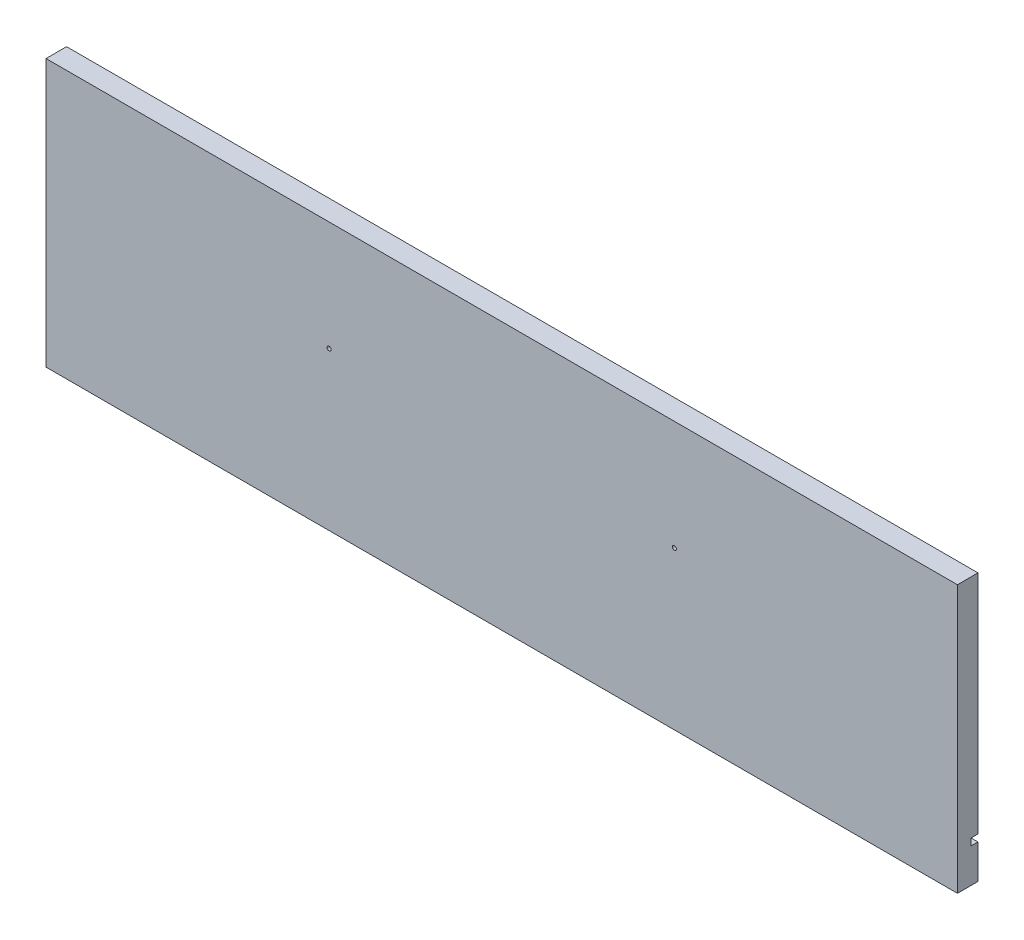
ISO-10303-21;
HEADER;
FILE_DESCRIPTION(('STEP AP214'),'2;1');
FILE_NAME('part.step','',(''),(''),'','','');
FILE_SCHEMA(('AUTOMOTIVE_DESIGN { 1 0 10303 214 1 1 1 1 }'));
ENDSEC;
DATA;
#1=APPLICATION_CONTEXT('core data for automotive mechanical design processes');
#2=APPLICATION_PROTOCOL_DEFINITION('international standard','automotive_design',2000,#1);
#3=PRODUCT_CONTEXT('',#1,'mechanical');
#4=PRODUCT('Part','Part','',(#3));
#5=PRODUCT_RELATED_PRODUCT_CATEGORY('part','',(#4));
#6=PRODUCT_DEFINITION_FORMATION('','',#4);
#7=PRODUCT_DEFINITION_CONTEXT('part definition',#1,'design');
#8=PRODUCT_DEFINITION('design','',#6,#7);
#9=PRODUCT_DEFINITION_SHAPE('','',#8);
#10=(LENGTH_UNIT() NAMED_UNIT(*) SI_UNIT(.MILLI.,.METRE.));
#11=(NAMED_UNIT(*) PLANE_ANGLE_UNIT() SI_UNIT($,.RADIAN.));
#12=(NAMED_UNIT(*) SI_UNIT($,.STERADIAN.) SOLID_ANGLE_UNIT());
#13=UNCERTAINTY_MEASURE_WITH_UNIT(LENGTH_MEASURE(1.E-05),#10,'distance_accuracy_value','');
#14=(GEOMETRIC_REPRESENTATION_CONTEXT(3) GLOBAL_UNCERTAINTY_ASSIGNED_CONTEXT((#13)) GLOBAL_UNIT_ASSIGNED_CONTEXT((#10,
#11,#12)) REPRESENTATION_CONTEXT('',''));
#15=CARTESIAN_POINT('',(0.,0.,0.));
#16=DIRECTION('',(0.,0.,1.));
#17=DIRECTION('',(1.,0.,0.));
#18=AXIS2_PLACEMENT_3D('',#15,#16,#17);
#19=CARTESIAN_POINT('',(-332.5,195.,-15.));
#20=DIRECTION('',(0.,0.,-1.));
#21=DIRECTION('',(-1.,0.,0.));
#22=AXIS2_PLACEMENT_3D('',#19,#20,#21);
#23=PLANE('',#22);
#24=CARTESIAN_POINT('',(325.,135.,-15.));
#25=DIRECTION('',(0.,0.,-1.));
#26=DIRECTION('',(-1.,0.,0.));
#27=AXIS2_PLACEMENT_3D('',#24,#25,#26);
#28=CIRCLE('',#27,1.5);
#29=CARTESIAN_POINT('',(323.5,135.,-15.));
#30=VERTEX_POINT('',#29);
#31=EDGE_CURVE('E113',#30,#30,#28,.T.);
#32=ORIENTED_EDGE('',*,*,#31,.F.);
#33=EDGE_LOOP('',(#32));
#34=FACE_BOUND('',#33,.T.);
#35=CARTESIAN_POINT('',(325.,45.0000000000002,-15.));
#36=DIRECTION('',(0.,0.,-1.));
#37=DIRECTION('',(-1.,0.,0.));
#38=AXIS2_PLACEMENT_3D('',#35,#36,#37);
#39=CIRCLE('',#38,1.5);
#40=CARTESIAN_POINT('',(323.5,45.0000000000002,-15.));
#41=VERTEX_POINT('',#40);
#42=EDGE_CURVE('E121',#41,#41,#39,.T.);
#43=ORIENTED_EDGE('',*,*,#42,.F.);
#44=EDGE_LOOP('',(#43));
#45=FACE_BOUND('',#44,.T.);
#46=CARTESIAN_POINT('',(-325.,135.000000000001,-15.));
#47=DIRECTION('',(0.,0.,-1.));
#48=DIRECTION('',(-1.,0.,0.));
#49=AXIS2_PLACEMENT_3D('',#46,#47,#48);
#50=CIRCLE('',#49,1.5);
#51=CARTESIAN_POINT('',(-326.5,135.000000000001,-15.));
#52=VERTEX_POINT('',#51);
#53=EDGE_CURVE('E127',#52,#52,#50,.T.);
#54=ORIENTED_EDGE('',*,*,#53,.F.);
#55=EDGE_LOOP('',(#54));
#56=FACE_BOUND('',#55,.T.);
#57=CARTESIAN_POINT('',(-325.,45.0000000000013,-15.));
#58=DIRECTION('',(0.,0.,-1.));
#59=DIRECTION('',(-1.,0.,0.));
#60=AXIS2_PLACEMENT_3D('',#57,#58,#59);
#61=CIRCLE('',#60,1.5);
#62=CARTESIAN_POINT('',(-326.5,45.0000000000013,-15.));
#63=VERTEX_POINT('',#62);
#64=EDGE_CURVE('E133',#63,#63,#61,.T.);
#65=ORIENTED_EDGE('',*,*,#64,.F.);
#66=EDGE_LOOP('',(#65));
#67=FACE_BOUND('',#66,.T.);
#68=CARTESIAN_POINT('',(126.,115.,-15.));
#69=DIRECTION('',(0.,0.,1.));
#70=DIRECTION('',(1.,0.,0.));
#71=AXIS2_PLACEMENT_3D('',#68,#69,#70);
#72=CIRCLE('',#71,1.5);
#73=CARTESIAN_POINT('',(127.5,115.,-15.));
#74=VERTEX_POINT('',#73);
#75=EDGE_CURVE('E142',#74,#74,#72,.T.);
#76=ORIENTED_EDGE('',*,*,#75,.T.);
#77=EDGE_LOOP('',(#76));
#78=FACE_BOUND('',#77,.T.);
#79=DIRECTION('',(1.,0.,0.));
#80=VECTOR('',#79,1.);
#81=CARTESIAN_POINT('',(-332.5,30.0000000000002,-15.));
#82=LINE('',#81,#80);
#83=CARTESIAN_POINT('',(-332.5,30.0000000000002,-15.));
#84=VERTEX_POINT('',#83);
#85=CARTESIAN_POINT('',(332.5,30.0000000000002,-15.));
#86=VERTEX_POINT('',#85);
#87=EDGE_CURVE('E163',#84,#86,#82,.T.);
#88=ORIENTED_EDGE('',*,*,#87,.F.);
#89=DIRECTION('',(0.,-1.,0.));
#90=VECTOR('',#89,1.);
#91=CARTESIAN_POINT('',(-332.5,0.,-15.));
#92=LINE('',#91,#90);
#93=CARTESIAN_POINT('',(-332.5,195.,-15.));
#94=VERTEX_POINT('',#93);
#95=EDGE_CURVE('E185',#94,#84,#92,.T.);
#96=ORIENTED_EDGE('',*,*,#95,.F.);
#97=DIRECTION('',(-1.,0.,0.));
#98=VECTOR('',#97,1.);
#99=CARTESIAN_POINT('',(-332.5,195.,-15.));
#100=LINE('',#99,#98);
#101=CARTESIAN_POINT('',(332.5,195.,-15.));
#102=VERTEX_POINT('',#101);
#103=EDGE_CURVE('E194',#102,#94,#100,.T.);
#104=ORIENTED_EDGE('',*,*,#103,.F.);
#105=DIRECTION('',(0.,1.,0.));
#106=VECTOR('',#105,1.);
#107=CARTESIAN_POINT('',(332.5,1.22154483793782E-13,-15.));
#108=LINE('',#107,#106);
#109=EDGE_CURVE('E190',#86,#102,#108,.T.);
#110=ORIENTED_EDGE('',*,*,#109,.F.);
#111=EDGE_LOOP('',(#88,#96,#104,#110));
#112=FACE_BOUND('',#111,.T.);
#113=CARTESIAN_POINT('',(-126.,115.,-15.));
#114=DIRECTION('',(0.,0.,1.));
#115=DIRECTION('',(1.,0.,0.));
#116=AXIS2_PLACEMENT_3D('',#113,#114,#115);
#117=CIRCLE('',#116,1.5);
#118=CARTESIAN_POINT('',(-124.5,115.,-15.));
#119=VERTEX_POINT('',#118);
#120=EDGE_CURVE('E136',#119,#119,#117,.T.);
#121=ORIENTED_EDGE('',*,*,#120,.T.);
#122=EDGE_LOOP('',(#121));
#123=FACE_BOUND('',#122,.T.);
#124=ADVANCED_FACE('F28',(#34,#45,#56,#67,#78,#112,#123),#23,.T.);
#125=DIRECTION('',(1.,0.,0.));
#126=VECTOR('',#125,1.);
#127=CARTESIAN_POINT('',(-332.5,25.0000000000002,-15.));
#128=LINE('',#127,#126);
#129=CARTESIAN_POINT('',(-332.5,25.0000000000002,-15.));
#130=VERTEX_POINT('',#129);
#131=CARTESIAN_POINT('',(332.5,25.0000000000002,-15.));
#132=VERTEX_POINT('',#131);
#133=EDGE_CURVE('E164',#130,#132,#128,.T.);
#134=ORIENTED_EDGE('',*,*,#133,.T.);
#135=CARTESIAN_POINT('',(332.5,1.22154483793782E-13,-15.));
#136=VERTEX_POINT('',#135);
#137=EDGE_CURVE('E191',#136,#132,#108,.T.);
#138=ORIENTED_EDGE('',*,*,#137,.F.);
#139=DIRECTION('',(1.,0.,0.));
#140=VECTOR('',#139,1.);
#141=CARTESIAN_POINT('',(-332.5,0.,-15.));
#142=LINE('',#141,#140);
#143=CARTESIAN_POINT('',(-332.5,0.,-15.));
#144=VERTEX_POINT('',#143);
#145=EDGE_CURVE('E187',#144,#136,#142,.T.);
#146=ORIENTED_EDGE('',*,*,#145,.F.);
#147=EDGE_CURVE('E184',#130,#144,#92,.T.);
#148=ORIENTED_EDGE('',*,*,#147,.F.);
#149=EDGE_LOOP('',(#134,#138,#146,#148));
#150=FACE_BOUND('',#149,.T.);
#151=ADVANCED_FACE('F225',(#150),#23,.T.);
#152=CARTESIAN_POINT('',(-332.5,0.,-15.));
#153=DIRECTION('',(-1.,0.,0.));
#154=DIRECTION('',(0.,0.,1.));
#155=AXIS2_PLACEMENT_3D('',#152,#153,#154);
#156=PLANE('',#155);
#157=DIRECTION('',(0.,0.,-1.));
#158=VECTOR('',#157,1.);
#159=CARTESIAN_POINT('',(-332.5,25.0000000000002,-15.));
#160=LINE('',#159,#158);
#161=CARTESIAN_POINT('',(-332.5,25.0000000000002,-10.));
#162=VERTEX_POINT('',#161);
#163=EDGE_CURVE('E160',#162,#130,#160,.T.);
#164=ORIENTED_EDGE('',*,*,#163,.T.);
#165=ORIENTED_EDGE('',*,*,#147,.T.);
#166=DIRECTION('',(0.,0.,1.));
#167=VECTOR('',#166,1.);
#168=CARTESIAN_POINT('',(-332.5,0.,-15.));
#169=LINE('',#168,#167);
#170=CARTESIAN_POINT('',(-332.5,0.,0.));
#171=VERTEX_POINT('',#170);
#172=EDGE_CURVE('E32',#144,#171,#169,.T.);
#173=ORIENTED_EDGE('',*,*,#172,.T.);
#174=DIRECTION('',(0.,-1.,0.));
#175=VECTOR('',#174,1.);
#176=CARTESIAN_POINT('',(-332.5,0.,0.));
#177=LINE('',#176,#175);
#178=CARTESIAN_POINT('',(-332.5,195.,0.));
#179=VERTEX_POINT('',#178);
#180=EDGE_CURVE('E167',#179,#171,#177,.T.);
#181=ORIENTED_EDGE('',*,*,#180,.F.);
#182=DIRECTION('',(0.,0.,1.));
#183=VECTOR('',#182,1.);
#184=CARTESIAN_POINT('',(-332.5,195.,-15.));
#185=LINE('',#184,#183);
#186=EDGE_CURVE('E11',#94,#179,#185,.T.);
#187=ORIENTED_EDGE('',*,*,#186,.F.);
#188=ORIENTED_EDGE('',*,*,#95,.T.);
#189=DIRECTION('',(0.,0.,1.));
#190=VECTOR('',#189,1.);
#191=CARTESIAN_POINT('',(-332.5,30.0000000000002,-15.));
#192=LINE('',#191,#190);
#193=CARTESIAN_POINT('',(-332.5,30.0000000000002,-10.));
#194=VERTEX_POINT('',#193);
#195=EDGE_CURVE('E45',#84,#194,#192,.T.);
#196=ORIENTED_EDGE('',*,*,#195,.T.);
#197=DIRECTION('',(0.,-1.,0.));
#198=VECTOR('',#197,1.);
#199=CARTESIAN_POINT('',(-332.5,25.0000000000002,-10.));
#200=LINE('',#199,#198);
#201=EDGE_CURVE('E157',#194,#162,#200,.T.);
#202=ORIENTED_EDGE('',*,*,#201,.T.);
#203=EDGE_LOOP('',(#164,#165,#173,#181,#187,#188,#196,#202));
#204=FACE_BOUND('',#203,.T.);
#205=ADVANCED_FACE('F30',(#204),#156,.T.);
#206=CARTESIAN_POINT('',(-332.5,195.,-15.));
#207=DIRECTION('',(0.,1.,0.));
#208=DIRECTION('',(-1.,0.,0.));
#209=AXIS2_PLACEMENT_3D('',#206,#207,#208);
#210=PLANE('',#209);
#211=DIRECTION('',(-1.,0.,0.));
#212=VECTOR('',#211,1.);
#213=CARTESIAN_POINT('',(-332.5,195.,0.));
#214=LINE('',#213,#212);
#215=CARTESIAN_POINT('',(332.5,195.,0.));
#216=VERTEX_POINT('',#215);
#217=EDGE_CURVE('E181',#216,#179,#214,.T.);
#218=ORIENTED_EDGE('',*,*,#217,.F.);
#219=DIRECTION('',(0.,0.,1.));
#220=VECTOR('',#219,1.);
#221=CARTESIAN_POINT('',(332.5,195.,-15.));
#222=LINE('',#221,#220);
#223=EDGE_CURVE('E37',#102,#216,#222,.T.);
#224=ORIENTED_EDGE('',*,*,#223,.F.);
#225=ORIENTED_EDGE('',*,*,#103,.T.);
#226=ORIENTED_EDGE('',*,*,#186,.T.);
#227=EDGE_LOOP('',(#218,#224,#225,#226));
#228=FACE_BOUND('',#227,.T.);
#229=ADVANCED_FACE('F210',(#228),#210,.T.);
#230=CARTESIAN_POINT('',(332.5,1.22154483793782E-13,-15.));
#231=DIRECTION('',(1.,0.,0.));
#232=DIRECTION('',(0.,1.,0.));
#233=AXIS2_PLACEMENT_3D('',#230,#231,#232);
#234=PLANE('',#233);
#235=DIRECTION('',(0.,0.,-1.));
#236=VECTOR('',#235,1.);
#237=CARTESIAN_POINT('',(332.5,25.0000000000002,-15.));
#238=LINE('',#237,#236);
#239=CARTESIAN_POINT('',(332.5,25.0000000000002,-10.));
#240=VERTEX_POINT('',#239);
#241=EDGE_CURVE('E154',#240,#132,#238,.T.);
#242=ORIENTED_EDGE('',*,*,#241,.F.);
#243=DIRECTION('',(0.,-1.,0.));
#244=VECTOR('',#243,1.);
#245=CARTESIAN_POINT('',(332.5,25.0000000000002,-10.));
#246=LINE('',#245,#244);
#247=CARTESIAN_POINT('',(332.5,30.0000000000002,-10.));
#248=VERTEX_POINT('',#247);
#249=EDGE_CURVE('E151',#248,#240,#246,.T.);
#250=ORIENTED_EDGE('',*,*,#249,.F.);
#251=DIRECTION('',(0.,0.,1.));
#252=VECTOR('',#251,1.);
#253=CARTESIAN_POINT('',(332.5,30.0000000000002,-15.));
#254=LINE('',#253,#252);
#255=EDGE_CURVE('E148',#86,#248,#254,.T.);
#256=ORIENTED_EDGE('',*,*,#255,.F.);
#257=ORIENTED_EDGE('',*,*,#109,.T.);
#258=ORIENTED_EDGE('',*,*,#223,.T.);
#259=DIRECTION('',(0.,1.,0.));
#260=VECTOR('',#259,1.);
#261=CARTESIAN_POINT('',(332.5,1.22154483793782E-13,0.));
#262=LINE('',#261,#260);
#263=CARTESIAN_POINT('',(332.5,1.22154483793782E-13,0.));
#264=VERTEX_POINT('',#263);
#265=EDGE_CURVE('E178',#264,#216,#262,.T.);
#266=ORIENTED_EDGE('',*,*,#265,.F.);
#267=DIRECTION('',(0.,0.,1.));
#268=VECTOR('',#267,1.);
#269=CARTESIAN_POINT('',(332.5,1.22154483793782E-13,-15.));
#270=LINE('',#269,#268);
#271=EDGE_CURVE('E197',#136,#264,#270,.T.);
#272=ORIENTED_EDGE('',*,*,#271,.F.);
#273=ORIENTED_EDGE('',*,*,#137,.T.);
#274=EDGE_LOOP('',(#242,#250,#256,#257,#258,#266,#272,#273));
#275=FACE_BOUND('',#274,.T.);
#276=ADVANCED_FACE('F227',(#275),#234,.T.);
#277=CARTESIAN_POINT('',(-332.5,0.,-15.));
#278=DIRECTION('',(0.,-1.,0.));
#279=DIRECTION('',(1.,0.,0.));
#280=AXIS2_PLACEMENT_3D('',#277,#278,#279);
#281=PLANE('',#280);
#282=DIRECTION('',(1.,0.,0.));
#283=VECTOR('',#282,1.);
#284=CARTESIAN_POINT('',(-332.5,0.,0.));
#285=LINE('',#284,#283);
#286=EDGE_CURVE('E175',#171,#264,#285,.T.);
#287=ORIENTED_EDGE('',*,*,#286,.F.);
#288=ORIENTED_EDGE('',*,*,#172,.F.);
#289=ORIENTED_EDGE('',*,*,#145,.T.);
#290=ORIENTED_EDGE('',*,*,#271,.T.);
#291=EDGE_LOOP('',(#287,#288,#289,#290));
#292=FACE_BOUND('',#291,.T.);
#293=ADVANCED_FACE('F204',(#292),#281,.T.);
#294=CARTESIAN_POINT('',(-332.5,195.,0.));
#295=DIRECTION('',(0.,0.,-1.));
#296=DIRECTION('',(-1.,0.,0.));
#297=AXIS2_PLACEMENT_3D('',#294,#295,#296);
#298=PLANE('',#297);
#299=CARTESIAN_POINT('',(-126.,115.,0.));
#300=DIRECTION('',(0.,0.,1.));
#301=DIRECTION('',(1.,0.,0.));
#302=AXIS2_PLACEMENT_3D('',#299,#300,#301);
#303=CIRCLE('',#302,1.5);
#304=CARTESIAN_POINT('',(-124.5,115.,0.));
#305=VERTEX_POINT('',#304);
#306=EDGE_CURVE('E139',#305,#305,#303,.T.);
#307=ORIENTED_EDGE('',*,*,#306,.F.);
#308=EDGE_LOOP('',(#307));
#309=FACE_BOUND('',#308,.T.);
#310=CARTESIAN_POINT('',(126.,115.,0.));
#311=DIRECTION('',(0.,0.,1.));
#312=DIRECTION('',(1.,0.,0.));
#313=AXIS2_PLACEMENT_3D('',#310,#311,#312);
#314=CIRCLE('',#313,1.5);
#315=CARTESIAN_POINT('',(127.5,115.,0.));
#316=VERTEX_POINT('',#315);
#317=EDGE_CURVE('E145',#316,#316,#314,.T.);
#318=ORIENTED_EDGE('',*,*,#317,.F.);
#319=EDGE_LOOP('',(#318));
#320=FACE_BOUND('',#319,.T.);
#321=ORIENTED_EDGE('',*,*,#180,.T.);
#322=ORIENTED_EDGE('',*,*,#286,.T.);
#323=ORIENTED_EDGE('',*,*,#265,.T.);
#324=ORIENTED_EDGE('',*,*,#217,.T.);
#325=EDGE_LOOP('',(#321,#322,#323,#324));
#326=FACE_BOUND('',#325,.T.);
#327=ADVANCED_FACE('F206',(#309,#320,#326),#298,.F.);
#328=CARTESIAN_POINT('',(-332.5,25.0000000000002,-15.));
#329=DIRECTION('',(0.,-1.,0.));
#330=DIRECTION('',(0.,0.,-1.));
#331=AXIS2_PLACEMENT_3D('',#328,#329,#330);
#332=PLANE('',#331);
#333=ORIENTED_EDGE('',*,*,#241,.T.);
#334=ORIENTED_EDGE('',*,*,#133,.F.);
#335=ORIENTED_EDGE('',*,*,#163,.F.);
#336=DIRECTION('',(1.,0.,0.));
#337=VECTOR('',#336,1.);
#338=CARTESIAN_POINT('',(-332.5,25.0000000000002,-10.));
#339=LINE('',#338,#337);
#340=EDGE_CURVE('E168',#162,#240,#339,.T.);
#341=ORIENTED_EDGE('',*,*,#340,.T.);
#342=EDGE_LOOP('',(#333,#334,#335,#341));
#343=FACE_BOUND('',#342,.T.);
#344=ADVANCED_FACE('F222',(#343),#332,.F.);
#345=CARTESIAN_POINT('',(-332.5,25.0000000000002,-10.));
#346=DIRECTION('',(0.,0.,1.));
#347=DIRECTION('',(1.,0.,0.));
#348=AXIS2_PLACEMENT_3D('',#345,#346,#347);
#349=PLANE('',#348);
#350=ORIENTED_EDGE('',*,*,#249,.T.);
#351=ORIENTED_EDGE('',*,*,#340,.F.);
#352=ORIENTED_EDGE('',*,*,#201,.F.);
#353=DIRECTION('',(1.,0.,0.));
#354=VECTOR('',#353,1.);
#355=CARTESIAN_POINT('',(-332.5,30.0000000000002,-10.));
#356=LINE('',#355,#354);
#357=EDGE_CURVE('E170',#194,#248,#356,.T.);
#358=ORIENTED_EDGE('',*,*,#357,.T.);
#359=EDGE_LOOP('',(#350,#351,#352,#358));
#360=FACE_BOUND('',#359,.T.);
#361=ADVANCED_FACE('F218',(#360),#349,.F.);
#362=CARTESIAN_POINT('',(-332.5,30.0000000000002,-15.));
#363=DIRECTION('',(0.,1.,0.));
#364=DIRECTION('',(0.,0.,1.));
#365=AXIS2_PLACEMENT_3D('',#362,#363,#364);
#366=PLANE('',#365);
#367=ORIENTED_EDGE('',*,*,#255,.T.);
#368=ORIENTED_EDGE('',*,*,#357,.F.);
#369=ORIENTED_EDGE('',*,*,#195,.F.);
#370=ORIENTED_EDGE('',*,*,#87,.T.);
#371=EDGE_LOOP('',(#367,#368,#369,#370));
#372=FACE_BOUND('',#371,.T.);
#373=ADVANCED_FACE('F229',(#372),#366,.F.);
#374=CARTESIAN_POINT('',(126.,115.,0.));
#375=DIRECTION('',(0.,0.,1.));
#376=DIRECTION('',(1.,0.,0.));
#377=AXIS2_PLACEMENT_3D('',#374,#375,#376);
#378=CYLINDRICAL_SURFACE('',#377,1.5);
#379=ORIENTED_EDGE('',*,*,#75,.F.);
#380=EDGE_LOOP('',(#379));
#381=FACE_BOUND('',#380,.T.);
#382=ORIENTED_EDGE('',*,*,#317,.T.);
#383=EDGE_LOOP('',(#382));
#384=FACE_BOUND('',#383,.T.);
#385=ADVANCED_FACE('F231',(#381,#384),#378,.F.);
#386=CARTESIAN_POINT('',(-126.,115.,0.));
#387=DIRECTION('',(0.,0.,1.));
#388=DIRECTION('',(1.,0.,0.));
#389=AXIS2_PLACEMENT_3D('',#386,#387,#388);
#390=CYLINDRICAL_SURFACE('',#389,1.5);
#391=ORIENTED_EDGE('',*,*,#120,.F.);
#392=EDGE_LOOP('',(#391));
#393=FACE_BOUND('',#392,.T.);
#394=ORIENTED_EDGE('',*,*,#306,.T.);
#395=EDGE_LOOP('',(#394));
#396=FACE_BOUND('',#395,.T.);
#397=ADVANCED_FACE('F238',(#393,#396),#390,.F.);
#398=CARTESIAN_POINT('',(-325.,45.0000000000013,-15.));
#399=DIRECTION('',(0.,0.,-1.));
#400=DIRECTION('',(-1.,0.,0.));
#401=AXIS2_PLACEMENT_3D('',#398,#399,#400);
#402=CYLINDRICAL_SURFACE('',#401,1.5);
#403=CARTESIAN_POINT('',(-325.,45.0000000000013,-5.));
#404=DIRECTION('',(0.,0.,-1.));
#405=DIRECTION('',(-1.,0.,0.));
#406=AXIS2_PLACEMENT_3D('',#403,#404,#405);
#407=CIRCLE('',#406,1.5);
#408=CARTESIAN_POINT('',(-326.5,45.0000000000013,-5.));
#409=VERTEX_POINT('',#408);
#410=EDGE_CURVE('E130',#409,#409,#407,.T.);
#411=ORIENTED_EDGE('',*,*,#410,.F.);
#412=EDGE_LOOP('',(#411));
#413=FACE_BOUND('',#412,.T.);
#414=ORIENTED_EDGE('',*,*,#64,.T.);
#415=EDGE_LOOP('',(#414));
#416=FACE_BOUND('',#415,.T.);
#417=ADVANCED_FACE('F270',(#413,#416),#402,.F.);
#418=CARTESIAN_POINT('',(-325.,45.0000000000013,-5.));
#419=DIRECTION('',(0.,0.,-1.));
#420=DIRECTION('',(-1.,0.,0.));
#421=AXIS2_PLACEMENT_3D('',#418,#419,#420);
#422=CONICAL_SURFACE('',#421,1.5,1.02974425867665);
#423=CARTESIAN_POINT('',(-325.,45.0000000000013,-4.09870907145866));
#424=VERTEX_POINT('',#423);
#425=VERTEX_LOOP('',#424);
#426=FACE_BOUND('',#425,.T.);
#427=ORIENTED_EDGE('',*,*,#410,.T.);
#428=EDGE_LOOP('',(#427));
#429=FACE_BOUND('',#428,.T.);
#430=ADVANCED_FACE('F275',(#426,#429),#422,.F.);
#431=CARTESIAN_POINT('',(-325.,135.000000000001,-15.));
#432=DIRECTION('',(0.,0.,-1.));
#433=DIRECTION('',(-1.,0.,0.));
#434=AXIS2_PLACEMENT_3D('',#431,#432,#433);
#435=CYLINDRICAL_SURFACE('',#434,1.5);
#436=CARTESIAN_POINT('',(-325.,135.000000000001,-5.));
#437=DIRECTION('',(0.,0.,-1.));
#438=DIRECTION('',(-1.,0.,0.));
#439=AXIS2_PLACEMENT_3D('',#436,#437,#438);
#440=CIRCLE('',#439,1.5);
#441=CARTESIAN_POINT('',(-326.5,135.000000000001,-5.));
#442=VERTEX_POINT('',#441);
#443=EDGE_CURVE('E124',#442,#442,#440,.T.);
#444=ORIENTED_EDGE('',*,*,#443,.F.);
#445=EDGE_LOOP('',(#444));
#446=FACE_BOUND('',#445,.T.);
#447=ORIENTED_EDGE('',*,*,#53,.T.);
#448=EDGE_LOOP('',(#447));
#449=FACE_BOUND('',#448,.T.);
#450=ADVANCED_FACE('F282',(#446,#449),#435,.F.);
#451=CARTESIAN_POINT('',(-325.,135.000000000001,-5.));
#452=DIRECTION('',(0.,0.,-1.));
#453=DIRECTION('',(-1.,0.,0.));
#454=AXIS2_PLACEMENT_3D('',#451,#452,#453);
#455=CONICAL_SURFACE('',#454,1.5,1.02974425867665);
#456=CARTESIAN_POINT('',(-325.,135.000000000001,-4.09870907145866));
#457=VERTEX_POINT('',#456);
#458=VERTEX_LOOP('',#457);
#459=FACE_BOUND('',#458,.T.);
#460=ORIENTED_EDGE('',*,*,#443,.T.);
#461=EDGE_LOOP('',(#460));
#462=FACE_BOUND('',#461,.T.);
#463=ADVANCED_FACE('F286',(#459,#462),#455,.F.);
#464=CARTESIAN_POINT('',(325.,45.0000000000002,-15.));
#465=DIRECTION('',(0.,0.,-1.));
#466=DIRECTION('',(-1.,0.,0.));
#467=AXIS2_PLACEMENT_3D('',#464,#465,#466);
#468=CYLINDRICAL_SURFACE('',#467,1.5);
#469=CARTESIAN_POINT('',(325.,45.0000000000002,-5.));
#470=DIRECTION('',(0.,0.,-1.));
#471=DIRECTION('',(-1.,0.,0.));
#472=AXIS2_PLACEMENT_3D('',#469,#470,#471);
#473=CIRCLE('',#472,1.5);
#474=CARTESIAN_POINT('',(323.5,45.0000000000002,-5.));
#475=VERTEX_POINT('',#474);
#476=EDGE_CURVE('E116',#475,#475,#473,.T.);
#477=ORIENTED_EDGE('',*,*,#476,.F.);
#478=EDGE_LOOP('',(#477));
#479=FACE_BOUND('',#478,.T.);
#480=ORIENTED_EDGE('',*,*,#42,.T.);
#481=EDGE_LOOP('',(#480));
#482=FACE_BOUND('',#481,.T.);
#483=ADVANCED_FACE('F290',(#479,#482),#468,.F.);
#484=CARTESIAN_POINT('',(325.,45.0000000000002,-5.));
#485=DIRECTION('',(0.,0.,-1.));
#486=DIRECTION('',(-1.,0.,0.));
#487=AXIS2_PLACEMENT_3D('',#484,#485,#486);
#488=CONICAL_SURFACE('',#487,1.5,1.02974425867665);
#489=CARTESIAN_POINT('',(325.,45.0000000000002,-4.09870907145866));
#490=VERTEX_POINT('',#489);
#491=VERTEX_LOOP('',#490);
#492=FACE_BOUND('',#491,.T.);
#493=ORIENTED_EDGE('',*,*,#476,.T.);
#494=EDGE_LOOP('',(#493));
#495=FACE_BOUND('',#494,.T.);
#496=ADVANCED_FACE('F294',(#492,#495),#488,.F.);
#497=CARTESIAN_POINT('',(325.,135.,-15.));
#498=DIRECTION('',(0.,0.,-1.));
#499=DIRECTION('',(-1.,0.,0.));
#500=AXIS2_PLACEMENT_3D('',#497,#498,#499);
#501=CYLINDRICAL_SURFACE('',#500,1.5);
#502=CARTESIAN_POINT('',(325.,135.,-5.));
#503=DIRECTION('',(0.,0.,-1.));
#504=DIRECTION('',(-1.,0.,0.));
#505=AXIS2_PLACEMENT_3D('',#502,#503,#504);
#506=CIRCLE('',#505,1.5);
#507=CARTESIAN_POINT('',(323.5,135.,-5.));
#508=VERTEX_POINT('',#507);
#509=EDGE_CURVE('E111',#508,#508,#506,.T.);
#510=ORIENTED_EDGE('',*,*,#509,.F.);
#511=EDGE_LOOP('',(#510));
#512=FACE_BOUND('',#511,.T.);
#513=ORIENTED_EDGE('',*,*,#31,.T.);
#514=EDGE_LOOP('',(#513));
#515=FACE_BOUND('',#514,.T.);
#516=ADVANCED_FACE('F107',(#512,#515),#501,.F.);
#517=CARTESIAN_POINT('',(325.,135.,-5.));
#518=DIRECTION('',(0.,0.,-1.));
#519=DIRECTION('',(-1.,0.,0.));
#520=AXIS2_PLACEMENT_3D('',#517,#518,#519);
#521=CONICAL_SURFACE('',#520,1.5,1.02974425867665);
#522=CARTESIAN_POINT('',(325.,135.,-4.09870907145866));
#523=VERTEX_POINT('',#522);
#524=VERTEX_LOOP('',#523);
#525=FACE_BOUND('',#524,.T.);
#526=ORIENTED_EDGE('',*,*,#509,.T.);
#527=EDGE_LOOP('',(#526));
#528=FACE_BOUND('',#527,.T.);
#529=ADVANCED_FACE('F104',(#525,#528),#521,.F.);
#530=CLOSED_SHELL('',(#124,#151,#205,#229,#276,#293,#327,#344,#361,#373,#385,#397,#417,#430,
#450,#463,#483,#496,#516,#529));
#531=MANIFOLD_SOLID_BREP('B2',#530);
#532=ADVANCED_BREP_SHAPE_REPRESENTATION('',(#18,#531),#14);
#533=SHAPE_DEFINITION_REPRESENTATION(#9,#532);
ENDSEC;
END-ISO-10303-21;
